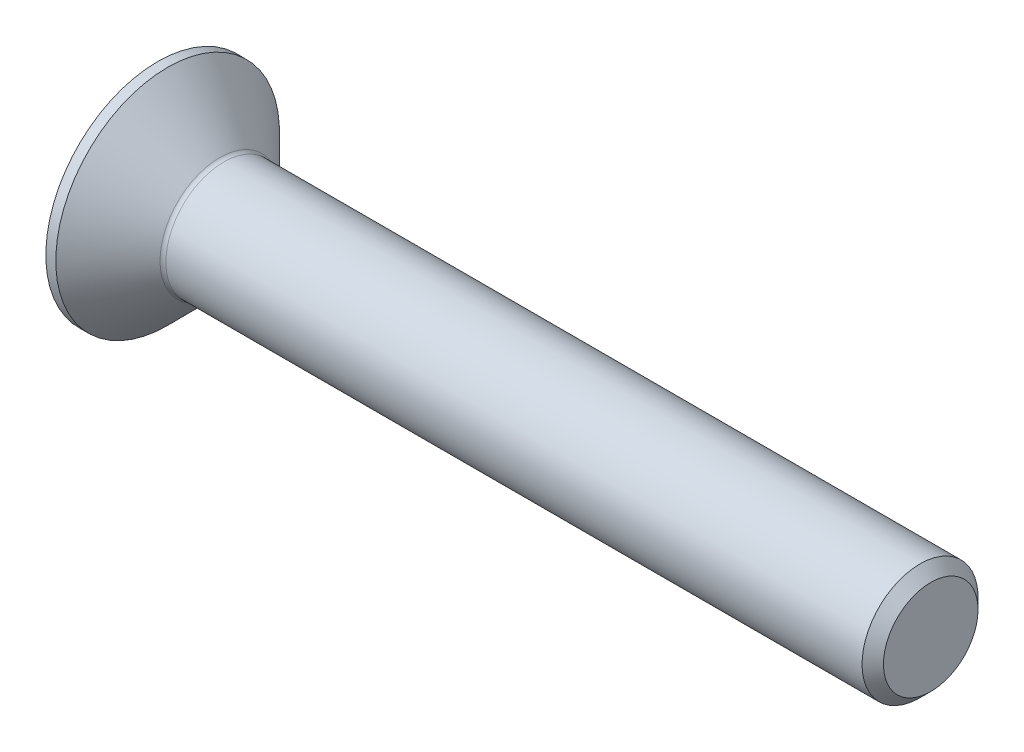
from build123d import *

# Parameters (mm, degrees)
CUT_EXTRUDE_1_DEPTH = 2.5


with BuildPart() as part:
    # Sketch 1 → Revolve 1 (revolve)
    with BuildSketch(Plane.XY):
        with BuildLine():
            Line((0, 5.785), (0.515, 5.785))
            Line((0.515, 5.785), (3.212132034, 3.087867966))
            ThreePointArc((3.212132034, 3.087867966), (3.309459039, 3.02283614), (3.424264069, 3))
            Line((3.424264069, 3), (39.4455, 3))
            Line((39.4455, 3), (40, 2.4455))
            Line((40, 2.4455), (40, 0))
            Line((40, 0), (0, 0))
            Line((0, 0), (0, 5.785))
        make_face()
    revolve(axis=Axis((40, 0, 0), (-1, 0, 0)))

    # Sketch 2 → Cut-Extrude 1 (cut)
    with BuildSketch(Plane.ZY):
        Polygon((2.01, -1.160474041), (2.01, 1.160474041), (0, 2.320948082), (-2.01, 1.160474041), (-2.01, -1.160474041), (0, -2.320948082), align=None)
    extrude(amount=-CUT_EXTRUDE_1_DEPTH, mode=Mode.SUBTRACT)

    # Sketch 3 → Cut-Revolve 1 (revolve, cut)
    with BuildSketch(Plane.XY, mode=Mode.PRIVATE) as cut_revolve_1_sk:
        Polygon((3.66, 0), (2.5, 2), (2.5, 0), align=None)
    revolve(cut_revolve_1_sk.sketch.rotate(Axis((2.5, 0, 0), (1, 0, 0)), 90), axis=Axis((2.5, 0, 0), (1, 0, 0)), mode=Mode.SUBTRACT)


solid = part.part
